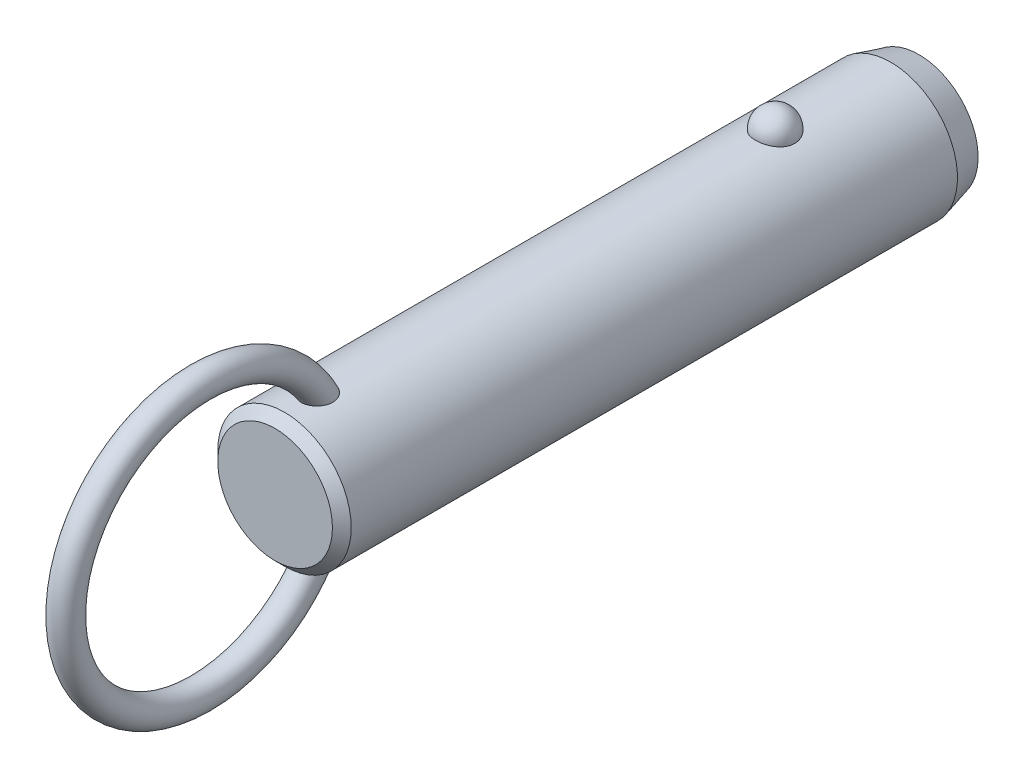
ISO-10303-21;
HEADER;
FILE_DESCRIPTION(('STEP AP214'),'2;1');
FILE_NAME('part.step','',(''),(''),'','','');
FILE_SCHEMA(('AUTOMOTIVE_DESIGN { 1 0 10303 214 1 1 1 1 }'));
ENDSEC;
DATA;
#1=APPLICATION_CONTEXT('core data for automotive mechanical design processes');
#2=APPLICATION_PROTOCOL_DEFINITION('international standard','automotive_design',2000,#1);
#3=PRODUCT_CONTEXT('',#1,'mechanical');
#4=PRODUCT('Part','Part','',(#3));
#5=PRODUCT_RELATED_PRODUCT_CATEGORY('part','',(#4));
#6=PRODUCT_DEFINITION_FORMATION('','',#4);
#7=PRODUCT_DEFINITION_CONTEXT('part definition',#1,'design');
#8=PRODUCT_DEFINITION('design','',#6,#7);
#9=PRODUCT_DEFINITION_SHAPE('','',#8);
#10=(LENGTH_UNIT() NAMED_UNIT(*) SI_UNIT(.MILLI.,.METRE.));
#11=(NAMED_UNIT(*) PLANE_ANGLE_UNIT() SI_UNIT($,.RADIAN.));
#12=(NAMED_UNIT(*) SI_UNIT($,.STERADIAN.) SOLID_ANGLE_UNIT());
#13=UNCERTAINTY_MEASURE_WITH_UNIT(LENGTH_MEASURE(1.E-05),#10,'distance_accuracy_value','');
#14=(GEOMETRIC_REPRESENTATION_CONTEXT(3) GLOBAL_UNCERTAINTY_ASSIGNED_CONTEXT((#13)) GLOBAL_UNIT_ASSIGNED_CONTEXT((#10,
#11,#12)) REPRESENTATION_CONTEXT('',''));
#15=CARTESIAN_POINT('',(0.,0.,0.));
#16=DIRECTION('',(0.,0.,1.));
#17=DIRECTION('',(1.,0.,0.));
#18=AXIS2_PLACEMENT_3D('',#15,#16,#17);
#19=CARTESIAN_POINT('',(0.,0.,43.2));
#20=DIRECTION('',(0.,0.,-1.));
#21=DIRECTION('',(-1.,0.,0.));
#22=AXIS2_PLACEMENT_3D('',#19,#20,#21);
#23=CYLINDRICAL_SURFACE('',#22,7.1);
#24=CARTESIAN_POINT('',(2.0769088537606,6.78943661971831,-2.1));
#25=CARTESIAN_POINT('',(2.07690739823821,6.78943796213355,-1.98268154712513));
#26=CARTESIAN_POINT('',(2.06738130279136,6.79237331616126,-1.86534506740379));
#27=CARTESIAN_POINT('',(2.0295040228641,6.8037853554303,-1.63400788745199));
#28=CARTESIAN_POINT('',(2.00114757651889,6.81226358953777,-1.52000812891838));
#29=CARTESIAN_POINT('',(1.92632025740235,6.83379798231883,-1.29863433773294));
#30=CARTESIAN_POINT('',(1.87985726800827,6.84685214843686,-1.19125744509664));
#31=CARTESIAN_POINT('',(1.76995205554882,6.87608091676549,-0.986046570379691));
#32=CARTESIAN_POINT('',(1.70650980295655,6.8922555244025,-0.888212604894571));
#33=CARTESIAN_POINT('',(1.56381192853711,6.92602930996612,-0.704242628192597));
#34=CARTESIAN_POINT('',(1.4844714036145,6.94363582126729,-0.618173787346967));
#35=CARTESIAN_POINT('',(1.31221746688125,6.97823658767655,-0.460740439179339));
#36=CARTESIAN_POINT('',(1.21930409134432,6.99523084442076,-0.389375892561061));
#37=CARTESIAN_POINT('',(1.02268781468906,7.02666176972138,-0.263547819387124));
#38=CARTESIAN_POINT('',(0.919020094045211,7.04110638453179,-0.209031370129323));
#39=CARTESIAN_POINT('',(0.703548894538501,7.06588726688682,-0.118163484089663));
#40=CARTESIAN_POINT('',(0.591746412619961,7.07622403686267,-0.081809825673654));
#41=CARTESIAN_POINT('',(0.365557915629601,7.09147068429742,-0.0288711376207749));
#42=CARTESIAN_POINT('',(0.251267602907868,7.09648447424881,-0.0119070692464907));
#43=CARTESIAN_POINT('',(0.0213499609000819,7.10089837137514,0.00304925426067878));
#44=CARTESIAN_POINT('',(-0.0942772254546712,7.10029907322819,0.00104351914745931));
#45=CARTESIAN_POINT('',(-0.321651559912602,7.09360829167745,-0.0216931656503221));
#46=CARTESIAN_POINT('',(-0.433431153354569,7.08760388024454,-0.0421272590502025));
#47=CARTESIAN_POINT('',(-0.651862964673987,7.07086131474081,-0.100729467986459));
#48=CARTESIAN_POINT('',(-0.758515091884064,7.06012307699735,-0.138897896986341));
#49=CARTESIAN_POINT('',(-0.96444924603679,7.03496097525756,-0.232213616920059));
#50=CARTESIAN_POINT('',(-1.06368095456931,7.02051445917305,-0.287465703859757));
#51=CARTESIAN_POINT('',(-1.25145353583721,6.98948740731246,-0.413383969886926));
#52=CARTESIAN_POINT('',(-1.33999321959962,6.97290663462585,-0.48405186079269));
#53=CARTESIAN_POINT('',(-1.50591604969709,6.93898770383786,-0.640594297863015));
#54=CARTESIAN_POINT('',(-1.58302488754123,6.92164094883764,-0.72675782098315));
#55=CARTESIAN_POINT('',(-1.72189320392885,6.8884103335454,-0.910927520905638));
#56=CARTESIAN_POINT('',(-1.78365144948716,6.87252659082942,-1.008934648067));
#57=CARTESIAN_POINT('',(-1.89101272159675,6.84377189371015,-1.21549497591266));
#58=CARTESIAN_POINT('',(-1.93639553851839,6.83094274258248,-1.32416860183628));
#59=CARTESIAN_POINT('',(-2.00874275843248,6.81002070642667,-1.54791500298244));
#60=CARTESIAN_POINT('',(-2.03570774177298,6.80192767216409,-1.66298757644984));
#61=CARTESIAN_POINT('',(-2.07047276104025,6.7914266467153,-1.89571453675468));
#62=CARTESIAN_POINT('',(-2.07835878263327,6.78899315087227,-2.01335491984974));
#63=CARTESIAN_POINT('',(-2.07502083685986,6.79001409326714,-2.24833570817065));
#64=CARTESIAN_POINT('',(-2.06379746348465,6.7934683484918,-2.36567612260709));
#65=CARTESIAN_POINT('',(-2.02263913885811,6.80583442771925,-2.59603194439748));
#66=CARTESIAN_POINT('',(-1.99281127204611,6.81471501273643,-2.70906820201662));
#67=CARTESIAN_POINT('',(-1.91526639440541,6.83691232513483,-2.92836575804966));
#68=CARTESIAN_POINT('',(-1.8675486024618,6.85022924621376,-3.03462676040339));
#69=CARTESIAN_POINT('',(-1.75504492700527,6.87991336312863,-3.23806487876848));
#70=CARTESIAN_POINT('',(-1.69015924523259,6.89629822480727,-3.33518422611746));
#71=CARTESIAN_POINT('',(-1.54505404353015,6.93024852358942,-3.51697105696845));
#72=CARTESIAN_POINT('',(-1.46483385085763,6.94781401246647,-3.60163799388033));
#73=CARTESIAN_POINT('',(-1.29071406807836,6.98225977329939,-3.75654119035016));
#74=CARTESIAN_POINT('',(-1.19675650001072,6.99913673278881,-3.82671308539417));
#75=CARTESIAN_POINT('',(-0.997940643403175,7.03023618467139,-3.9501837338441));
#76=CARTESIAN_POINT('',(-0.893083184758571,7.04445887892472,-4.00348377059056));
#77=CARTESIAN_POINT('',(-0.676902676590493,7.06848365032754,-4.09107242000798));
#78=CARTESIAN_POINT('',(-0.565686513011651,7.0783430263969,-4.12560889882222));
#79=CARTESIAN_POINT('',(-0.33873982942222,7.09282534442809,-4.17575450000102));
#80=CARTESIAN_POINT('',(-0.223009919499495,7.09744899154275,-4.19136617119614));
#81=CARTESIAN_POINT('',(0.00707628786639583,7.10090930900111,-4.20307965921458));
#82=CARTESIAN_POINT('',(0.121410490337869,7.09986531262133,-4.19958377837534));
#83=CARTESIAN_POINT('',(0.347815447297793,7.092380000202,-4.17411564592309));
#84=CARTESIAN_POINT('',(0.459886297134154,7.08593891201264,-4.15214417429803));
#85=CARTESIAN_POINT('',(0.678084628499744,7.06838983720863,-4.09049562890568));
#86=CARTESIAN_POINT('',(0.784237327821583,7.05730369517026,-4.05090137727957));
#87=CARTESIAN_POINT('',(0.988305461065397,7.03163139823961,-3.95511447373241));
#88=CARTESIAN_POINT('',(1.08622031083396,7.01704499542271,-3.89892064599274));
#89=CARTESIAN_POINT('',(1.27284490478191,6.98562668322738,-3.77035541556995));
#90=CARTESIAN_POINT('',(1.36137372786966,6.96876135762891,-3.69772964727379));
#91=CARTESIAN_POINT('',(1.52509486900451,6.93477412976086,-3.53878279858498));
#92=CARTESIAN_POINT('',(1.60028496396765,6.91765218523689,-3.45245943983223));
#93=CARTESIAN_POINT('',(1.73681688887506,6.88465753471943,-3.26658774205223));
#94=CARTESIAN_POINT('',(1.79785966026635,6.86881574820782,-3.16681408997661));
#95=CARTESIAN_POINT('',(1.90265327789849,6.84053157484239,-2.95814408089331));
#96=CARTESIAN_POINT('',(1.94640861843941,6.82808830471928,-2.84925010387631));
#97=CARTESIAN_POINT('',(2.01274378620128,6.80881460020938,-2.63454318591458));
#98=CARTESIAN_POINT('',(2.03676193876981,6.80160856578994,-2.52920574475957));
#99=CARTESIAN_POINT('',(2.06884490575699,6.79191902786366,-2.3159172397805));
#100=CARTESIAN_POINT('',(2.07691019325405,6.78943538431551,-2.20796625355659));
#101=CARTESIAN_POINT('',(2.0769088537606,6.78943661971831,-2.1));
#102=B_SPLINE_CURVE_WITH_KNOTS('',3,(#24,#25,#26,#27,#28,#29,#30,#31,#32,#33,#34,#35,#36,#37,
#38,#39,#40,#41,#42,#43,#44,#45,#46,#47,#48,#49,#50,#51,#52,#53,#54,#55,#56,#57,#58,#59,#60,#61,
#62,#63,#64,#65,#66,#67,#68,#69,#70,#71,#72,#73,#74,#75,#76,#77,#78,#79,#80,#81,#82,#83,#84,#85,
#86,#87,#88,#89,#90,#91,#92,#93,#94,#95,#96,#97,#98,#99,#100,#101),.UNSPECIFIED.,.T.,.F.,(4,2,2,
2,2,2,2,2,2,2,2,2,2,2,2,2,2,2,2,2,2,2,2,2,2,2,2,2,2,2,2,2,2,2,2,2,2,2,4),(0.,0.351568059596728,
0.703234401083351,1.05474780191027,1.40626181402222,1.75970563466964,2.11314851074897,
2.4654696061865,2.81774759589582,3.16301449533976,3.50824481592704,3.84801136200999,
4.18778391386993,4.52968352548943,4.87162112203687,5.22076181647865,5.56993054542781,
5.92363364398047,6.27732559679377,6.62942052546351,6.98150450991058,7.33158042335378,
7.68167162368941,8.03384443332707,8.38603269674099,8.73975272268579,9.09344583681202,
9.44234545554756,9.79119807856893,10.1327344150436,10.4742563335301,10.8141898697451,
11.1541474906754,11.4997793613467,11.8454687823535,12.1979079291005,12.5502553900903,
12.8738073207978,13.1973496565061),.UNSPECIFIED.);
#103=CARTESIAN_POINT('',(2.0769088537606,6.78943661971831,-2.1));
#104=VERTEX_POINT('',#103);
#105=EDGE_CURVE('E41',#104,#104,#102,.T.);
#106=ORIENTED_EDGE('',*,*,#105,.T.);
#107=EDGE_LOOP('',(#106));
#108=FACE_BOUND('',#107,.T.);
#109=CARTESIAN_POINT('',(0.,0.,50.12));
#110=DIRECTION('',(0.,0.,1.));
#111=DIRECTION('',(1.,0.,0.));
#112=AXIS2_PLACEMENT_3D('',#109,#110,#111);
#113=CIRCLE('',#112,7.1);
#114=CARTESIAN_POINT('',(7.1,0.,50.12));
#115=VERTEX_POINT('',#114);
#116=EDGE_CURVE('E10',#115,#115,#113,.F.);
#117=ORIENTED_EDGE('',*,*,#116,.T.);
#118=EDGE_LOOP('',(#117));
#119=FACE_BOUND('',#118,.T.);
#120=CARTESIAN_POINT('',(-0.429539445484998,-7.08699541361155,44.9429212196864));
#121=CARTESIAN_POINT('',(-0.50833166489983,-7.08221999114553,44.9668764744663));
#122=CARTESIAN_POINT('',(-0.585039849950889,-7.07624016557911,44.9974570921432));
#123=CARTESIAN_POINT('',(-0.732082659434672,-7.06254296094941,45.0710242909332));
#124=CARTESIAN_POINT('',(-0.802417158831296,-7.05482554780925,45.1140111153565));
#125=CARTESIAN_POINT('',(-0.934722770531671,-7.03851844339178,45.2111135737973));
#126=CARTESIAN_POINT('',(-0.996700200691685,-7.02992941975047,45.2652207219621));
#127=CARTESIAN_POINT('',(-1.11079942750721,-7.01280697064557,45.3829676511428));
#128=CARTESIAN_POINT('',(-1.16292136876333,-7.00427354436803,45.4466072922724));
#129=CARTESIAN_POINT('',(-1.25705660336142,-6.98799959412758,45.5826870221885));
#130=CARTESIAN_POINT('',(-1.29888032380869,-6.98027525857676,45.6552598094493));
#131=CARTESIAN_POINT('',(-1.37069920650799,-6.96652886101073,45.8061686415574));
#132=CARTESIAN_POINT('',(-1.40069157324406,-6.96050720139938,45.8845060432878));
#133=CARTESIAN_POINT('',(-1.45043507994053,-6.95031881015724,46.0501903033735));
#134=CARTESIAN_POINT('',(-1.46937115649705,-6.94630231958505,46.1377897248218));
#135=CARTESIAN_POINT('',(-1.49424917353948,-6.94099239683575,46.3148714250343));
#136=CARTESIAN_POINT('',(-1.50018601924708,-6.93970003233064,46.4043544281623));
#137=CARTESIAN_POINT('',(-1.49978214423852,-6.93978815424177,46.5940607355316));
#138=CARTESIAN_POINT('',(-1.49187639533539,-6.94150934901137,46.694279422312));
#139=CARTESIAN_POINT('',(-1.46177925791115,-6.94790814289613,46.8924798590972));
#140=CARTESIAN_POINT('',(-1.43957541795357,-6.95258831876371,46.990459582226));
#141=CARTESIAN_POINT('',(-1.37783293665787,-6.96510647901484,47.1953629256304));
#142=CARTESIAN_POINT('',(-1.33634073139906,-6.97328848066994,47.3016801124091));
#143=CARTESIAN_POINT('',(-1.23686994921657,-6.99161706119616,47.5061777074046));
#144=CARTESIAN_POINT('',(-1.17889192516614,-7.00176357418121,47.6043583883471));
#145=CARTESIAN_POINT('',(-1.0587512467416,-7.02082898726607,47.7723743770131));
#146=CARTESIAN_POINT('',(-0.999247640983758,-7.02963746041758,47.8441230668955));
#147=CARTESIAN_POINT('',(-0.86949477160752,-7.04686074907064,47.9771959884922));
#148=CARTESIAN_POINT('',(-0.799263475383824,-7.05527619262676,48.0385372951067));
#149=CARTESIAN_POINT('',(-0.665408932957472,-7.06899457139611,48.1351316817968));
#150=CARTESIAN_POINT('',(-0.603817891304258,-7.07457275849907,48.1731512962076));
#151=CARTESIAN_POINT('',(-0.475172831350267,-7.08437420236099,48.2387581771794));
#152=CARTESIAN_POINT('',(-0.40812301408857,-7.08859848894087,48.2663533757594));
#153=CARTESIAN_POINT('',(-0.269431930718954,-7.09522749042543,48.3092569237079));
#154=CARTESIAN_POINT('',(-0.197757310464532,-7.09761688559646,48.3244618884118));
#155=CARTESIAN_POINT('',(-0.0527849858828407,-7.10017268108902,48.3407168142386));
#156=CARTESIAN_POINT('',(0.020511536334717,-7.10034065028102,48.3417767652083));
#157=CARTESIAN_POINT('',(0.156426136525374,-7.09855986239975,48.3304619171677));
#158=CARTESIAN_POINT('',(0.219199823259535,-7.09688191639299,48.3198060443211));
#159=CARTESIAN_POINT('',(0.342134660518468,-7.09201880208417,48.2885379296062));
#160=CARTESIAN_POINT('',(0.402295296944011,-7.08883333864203,48.2679237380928));
#161=CARTESIAN_POINT('',(0.520687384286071,-7.08113868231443,48.2172125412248));
#162=CARTESIAN_POINT('',(0.578791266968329,-7.07658958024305,48.1868272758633));
#163=CARTESIAN_POINT('',(0.690173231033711,-7.06659708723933,48.1183678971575));
#164=CARTESIAN_POINT('',(0.743447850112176,-7.061153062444,48.0802883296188));
#165=CARTESIAN_POINT('',(0.870947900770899,-7.04680292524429,47.9765929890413));
#166=CARTESIAN_POINT('',(0.941828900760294,-7.0375580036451,47.9068972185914));
#167=CARTESIAN_POINT('',(1.07136606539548,-7.01900793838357,47.7569450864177));
#168=CARTESIAN_POINT('',(1.13000013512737,-7.00970271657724,47.6766700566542));
#169=CARTESIAN_POINT('',(1.23579584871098,-6.99183327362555,47.5068997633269));
#170=CARTESIAN_POINT('',(1.2827427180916,-6.98328455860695,47.4172696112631));
#171=CARTESIAN_POINT('',(1.36351442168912,-6.96796352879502,47.2321763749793));
#172=CARTESIAN_POINT('',(1.39733971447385,-6.96119115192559,47.1367134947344));
#173=CARTESIAN_POINT('',(1.45579181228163,-6.94922464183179,46.9253092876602));
#174=CARTESIAN_POINT('',(1.47790145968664,-6.94449000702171,46.808631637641));
#175=CARTESIAN_POINT('',(1.50168752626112,-6.93938731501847,46.5730153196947));
#176=CARTESIAN_POINT('',(1.50336085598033,-6.93901991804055,46.4540763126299));
#177=CARTESIAN_POINT('',(1.48486516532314,-6.9430010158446,46.2236079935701));
#178=CARTESIAN_POINT('',(1.46573441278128,-6.9471253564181,46.1119958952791));
#179=CARTESIAN_POINT('',(1.40606892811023,-6.95944667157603,45.8948868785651));
#180=CARTESIAN_POINT('',(1.36556446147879,-6.96763788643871,45.7893815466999));
#181=CARTESIAN_POINT('',(1.27082700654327,-6.98548038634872,45.6042879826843));
#182=CARTESIAN_POINT('',(1.21949810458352,-6.99473841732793,45.5231719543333));
#183=CARTESIAN_POINT('',(1.10242050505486,-7.01414069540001,45.3722278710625));
#184=CARTESIAN_POINT('',(1.03668119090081,-7.02428436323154,45.3023925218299));
#185=CARTESIAN_POINT('',(0.90055902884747,-7.04295285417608,45.1835735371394));
#186=CARTESIAN_POINT('',(0.831428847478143,-7.05153466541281,45.1331573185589));
#187=CARTESIAN_POINT('',(0.685291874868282,-7.06723150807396,45.0451429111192));
#188=CARTESIAN_POINT('',(0.60828720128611,-7.0743469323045,45.0075412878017));
#189=CARTESIAN_POINT('',(0.451878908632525,-7.08602232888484,44.9474915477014));
#190=CARTESIAN_POINT('',(0.372686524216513,-7.09067127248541,44.9245088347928));
#191=CARTESIAN_POINT('',(0.211477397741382,-7.09730788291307,44.8920357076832));
#192=CARTESIAN_POINT('',(0.129460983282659,-7.09929585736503,44.8825437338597));
#193=CARTESIAN_POINT('',(-0.0332905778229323,-7.10037858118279,44.8773517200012));
#194=CARTESIAN_POINT('',(-0.114016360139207,-7.09953334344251,44.8813656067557));
#195=CARTESIAN_POINT('',(-0.273670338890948,-7.09517338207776,44.9024540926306));
#196=CARTESIAN_POINT('',(-0.352598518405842,-7.09165863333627,44.9195288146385));
#197=CARTESIAN_POINT('',(-0.429539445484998,-7.08699541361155,44.9429212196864));
#198=B_SPLINE_CURVE_WITH_KNOTS('',3,(#120,#121,#122,#123,#124,#125,#126,#127,#128,#129,#130,
#131,#132,#133,#134,#135,#136,#137,#138,#139,#140,#141,#142,#143,#144,#145,#146,#147,#148,#149,
#150,#151,#152,#153,#154,#155,#156,#157,#158,#159,#160,#161,#162,#163,#164,#165,#166,#167,#168,
#169,#170,#171,#172,#173,#174,#175,#176,#177,#178,#179,#180,#181,#182,#183,#184,#185,#186,#187,
#188,#189,#190,#191,#192,#193,#194,#195,#196,#197),.UNSPECIFIED.,.T.,.F.,(4,2,2,2,2,2,2,2,2,2,2,
2,2,2,2,2,2,2,2,2,2,2,2,2,2,2,2,2,2,2,2,2,2,2,2,2,2,2,4),(0.,0.247183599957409,
0.494372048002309,0.741372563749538,0.98836945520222,1.23962059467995,1.49093106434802,
1.75897818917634,2.02713035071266,2.32758265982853,2.62829697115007,2.97008736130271,
3.31186629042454,3.5917531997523,3.87117637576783,4.08813841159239,4.30493502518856,
4.52352259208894,4.74195577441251,4.93215328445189,5.12238804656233,5.31884850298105,
5.51544871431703,5.8133231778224,6.11173048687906,6.41527266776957,6.71880423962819,
7.073581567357,7.42841252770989,7.76631485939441,8.10373999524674,8.3914224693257,
8.67891817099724,8.93560332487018,9.19221962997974,9.43881106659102,9.68537399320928,
9.92674752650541,10.1681233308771),.UNSPECIFIED.);
#199=CARTESIAN_POINT('',(-0.429539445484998,-7.08699541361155,44.9429212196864));
#200=VERTEX_POINT('',#199);
#201=EDGE_CURVE('E60',#200,#200,#198,.T.);
#202=ORIENTED_EDGE('',*,*,#201,.T.);
#203=EDGE_LOOP('',(#202));
#204=FACE_BOUND('',#203,.T.);
#205=CARTESIAN_POINT('',(-0.429539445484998,7.08699541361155,44.9429212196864));
#206=CARTESIAN_POINT('',(-0.351665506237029,7.09171429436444,44.9192469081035));
#207=CARTESIAN_POINT('',(-0.271733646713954,7.09525896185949,44.9020369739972));
#208=CARTESIAN_POINT('',(-0.110026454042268,7.09960839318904,44.8810059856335));
#209=CARTESIAN_POINT('',(-0.0282502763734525,7.10041187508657,44.877191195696));
#210=CARTESIAN_POINT('',(0.134782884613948,7.09918849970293,44.883059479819));
#211=CARTESIAN_POINT('',(0.216039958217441,7.09716214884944,44.8927401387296));
#212=CARTESIAN_POINT('',(0.375730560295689,7.09050177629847,44.9253471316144));
#213=CARTESIAN_POINT('',(0.454164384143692,7.08586802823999,44.9482720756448));
#214=CARTESIAN_POINT('',(0.606025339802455,7.07449911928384,45.006771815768));
#215=CARTESIAN_POINT('',(0.679451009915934,7.06776334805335,45.0423502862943));
#216=CARTESIAN_POINT('',(0.819234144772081,7.05292866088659,45.1251753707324));
#217=CARTESIAN_POINT('',(0.885591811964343,7.04482978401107,45.1724216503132));
#218=CARTESIAN_POINT('',(1.00993211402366,7.02808709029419,45.2775902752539));
#219=CARTESIAN_POINT('',(1.06785399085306,7.01943990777,45.335583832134));
#220=CARTESIAN_POINT('',(1.17342527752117,7.00256662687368,45.4603013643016));
#221=CARTESIAN_POINT('',(1.22107408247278,6.99434055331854,45.5270258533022));
#222=CARTESIAN_POINT('',(1.30652927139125,6.97889183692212,45.6693622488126));
#223=CARTESIAN_POINT('',(1.34399711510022,6.97170674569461,45.7451808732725));
#224=CARTESIAN_POINT('',(1.40682616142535,6.95930080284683,45.9018100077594));
#225=CARTESIAN_POINT('',(1.43218374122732,6.95408053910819,45.9826220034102));
#226=CARTESIAN_POINT('',(1.47246409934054,6.94566853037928,46.1535314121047));
#227=CARTESIAN_POINT('',(1.48642590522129,6.9426653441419,46.2438630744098));
#228=CARTESIAN_POINT('',(1.5011410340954,6.93949744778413,46.425619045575));
#229=CARTESIAN_POINT('',(1.50188917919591,6.93933385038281,46.5170437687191));
#230=CARTESIAN_POINT('',(1.49030464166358,6.94183245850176,46.7108438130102));
#231=CARTESIAN_POINT('',(1.47627413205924,6.94486147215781,46.813112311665));
#232=CARTESIAN_POINT('',(1.43356351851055,6.95380194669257,47.0144719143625));
#233=CARTESIAN_POINT('',(1.4048676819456,6.95971650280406,47.1135594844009));
#234=CARTESIAN_POINT('',(1.32908750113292,6.97461208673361,47.3189087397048));
#235=CARTESIAN_POINT('',(1.28011435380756,6.98388945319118,47.4244566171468));
#236=CARTESIAN_POINT('',(1.16520357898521,7.00397743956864,47.6257604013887));
#237=CARTESIAN_POINT('',(1.09927694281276,7.01478706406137,47.7215225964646));
#238=CARTESIAN_POINT('',(0.969361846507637,7.03373936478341,47.8767565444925));
#239=CARTESIAN_POINT('',(0.909042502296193,7.04187023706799,47.9393032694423));
#240=CARTESIAN_POINT('',(0.779178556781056,7.05741732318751,48.0540535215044));
#241=CARTESIAN_POINT('',(0.709649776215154,7.06483472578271,48.1062744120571));
#242=CARTESIAN_POINT('',(0.576854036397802,7.0767751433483,48.1881138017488));
#243=CARTESIAN_POINT('',(0.515118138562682,7.08158033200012,48.2201641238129));
#244=CARTESIAN_POINT('',(0.387127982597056,7.08972701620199,48.2737656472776));
#245=CARTESIAN_POINT('',(0.320877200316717,7.09306962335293,48.2953248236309));
#246=CARTESIAN_POINT('',(0.185041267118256,7.09791507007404,48.3264005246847));
#247=CARTESIAN_POINT('',(0.115437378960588,7.09940591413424,48.3358385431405));
#248=CARTESIAN_POINT('',(-0.0243157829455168,7.10030171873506,48.3415226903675));
#249=CARTESIAN_POINT('',(-0.094464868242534,7.0997073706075,48.3377731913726));
#250=CARTESIAN_POINT('',(-0.225713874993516,7.09668414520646,48.3185081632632));
#251=CARTESIAN_POINT('',(-0.287006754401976,7.09444865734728,48.3042323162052));
#252=CARTESIAN_POINT('',(-0.406555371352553,7.08860360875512,48.2663685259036));
#253=CARTESIAN_POINT('',(-0.464809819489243,7.08499346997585,48.2427766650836));
#254=CARTESIAN_POINT('',(-0.594955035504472,7.07541654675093,48.1789232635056));
#255=CARTESIAN_POINT('',(-0.665389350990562,7.06906574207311,48.135753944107));
#256=CARTESIAN_POINT('',(-0.798242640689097,7.05530261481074,48.038587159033));
#257=CARTESIAN_POINT('',(-0.860645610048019,7.0478882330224,47.9845686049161));
#258=CARTESIAN_POINT('',(-0.994249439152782,7.03045217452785,47.8509965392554));
#259=CARTESIAN_POINT('',(-1.06260129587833,7.02030745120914,47.7686143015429));
#260=CARTESIAN_POINT('',(-1.18502045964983,7.00068382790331,47.593843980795));
#261=CARTESIAN_POINT('',(-1.239076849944,6.99120544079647,47.501448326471));
#262=CARTESIAN_POINT('',(-1.33335589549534,6.97384343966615,47.3080085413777));
#263=CARTESIAN_POINT('',(-1.3733613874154,6.96598557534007,47.2068564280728));
#264=CARTESIAN_POINT('',(-1.43770677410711,6.9529905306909,46.9995046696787));
#265=CARTESIAN_POINT('',(-1.46204473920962,6.94785368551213,46.89330440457));
#266=CARTESIAN_POINT('',(-1.49537533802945,6.94076296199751,46.668231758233));
#267=CARTESIAN_POINT('',(-1.50273564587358,6.93914842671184,46.5490975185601));
#268=CARTESIAN_POINT('',(-1.4954555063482,6.94072368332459,46.3114703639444));
#269=CARTESIAN_POINT('',(-1.48082914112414,6.94391040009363,46.1929770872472));
#270=CARTESIAN_POINT('',(-1.43076401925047,6.95438579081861,45.9734325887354));
#271=CARTESIAN_POINT('',(-1.39762227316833,6.96121852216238,45.8718413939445));
#272=CARTESIAN_POINT('',(-1.31211274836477,6.97783941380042,45.6773513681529));
#273=CARTESIAN_POINT('',(-1.25976607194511,6.98762432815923,45.5844431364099));
#274=CARTESIAN_POINT('',(-1.14583073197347,7.00713153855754,45.4241601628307));
#275=CARTESIAN_POINT('',(-1.08665947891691,7.01665982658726,45.3550351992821));
#276=CARTESIAN_POINT('',(-0.956606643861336,7.03556646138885,45.2288786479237));
#277=CARTESIAN_POINT('',(-0.885737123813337,7.04494495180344,45.1718347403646));
#278=CARTESIAN_POINT('',(-0.751558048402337,7.06035735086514,45.0831004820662));
#279=CARTESIAN_POINT('',(-0.690120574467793,7.0666695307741,45.0485932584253));
#280=CARTESIAN_POINT('',(-0.562815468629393,7.07794609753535,44.9887507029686));
#281=CARTESIAN_POINT('',(-0.496948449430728,7.08291067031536,44.9634141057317));
#282=CARTESIAN_POINT('',(-0.429539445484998,7.08699541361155,44.9429212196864));
#283=B_SPLINE_CURVE_WITH_KNOTS('',3,(#205,#206,#207,#208,#209,#210,#211,#212,#213,#214,#215,
#216,#217,#218,#219,#220,#221,#222,#223,#224,#225,#226,#227,#228,#229,#230,#231,#232,#233,#234,
#235,#236,#237,#238,#239,#240,#241,#242,#243,#244,#245,#246,#247,#248,#249,#250,#251,#252,#253,
#254,#255,#256,#257,#258,#259,#260,#261,#262,#263,#264,#265,#266,#267,#268,#269,#270,#271,#272,
#273,#274,#275,#276,#277,#278,#279,#280,#281,#282),.UNSPECIFIED.,.T.,.F.,(4,2,2,2,2,2,2,2,2,2,2,
2,2,2,2,2,2,2,2,2,2,2,2,2,2,2,2,2,2,2,2,2,2,2,2,2,2,2,4),(0.,0.244335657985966,
0.488785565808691,0.733191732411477,0.977572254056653,1.22202379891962,1.46646834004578,
1.71259457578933,1.9587352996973,2.21226768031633,2.46587585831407,2.73913816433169,
3.01250754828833,3.32109936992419,3.63002293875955,3.97863512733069,4.32702187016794,
4.5879394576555,4.84841449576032,5.05676704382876,5.26496096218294,5.47449661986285,
5.68396281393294,5.87205447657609,6.06022532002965,6.30743751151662,6.55513496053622,
6.87602468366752,7.19715875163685,7.52305774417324,7.84899686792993,8.20516155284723,
8.5610982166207,8.88040084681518,9.19935367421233,9.47236282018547,9.74509220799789,
9.95662250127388,10.1681235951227),.UNSPECIFIED.);
#284=CARTESIAN_POINT('',(-0.429539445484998,7.08699541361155,44.9429212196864));
#285=VERTEX_POINT('',#284);
#286=EDGE_CURVE('E68',#285,#285,#283,.T.);
#287=ORIENTED_EDGE('',*,*,#286,.T.);
#288=EDGE_LOOP('',(#287));
#289=FACE_BOUND('',#288,.T.);
#290=CARTESIAN_POINT('',(0.,0.,-14.4));
#291=DIRECTION('',(0.,0.,-1.));
#292=DIRECTION('',(-1.,0.,0.));
#293=AXIS2_PLACEMENT_3D('',#290,#291,#292);
#294=CIRCLE('',#293,7.1);
#295=CARTESIAN_POINT('',(-7.1,0.,-14.4));
#296=VERTEX_POINT('',#295);
#297=EDGE_CURVE('E57',#296,#296,#294,.F.);
#298=ORIENTED_EDGE('',*,*,#297,.T.);
#299=EDGE_LOOP('',(#298));
#300=FACE_BOUND('',#299,.T.);
#301=ADVANCED_FACE('F37',(#108,#119,#204,#289,#300),#23,.T.);
#302=CARTESIAN_POINT('',(0.,0.,-17.4));
#303=DIRECTION('',(0.,0.,-1.));
#304=DIRECTION('',(-1.,0.,0.));
#305=AXIS2_PLACEMENT_3D('',#302,#303,#304);
#306=PLANE('',#305);
#307=CARTESIAN_POINT('',(0.,0.,-17.4));
#308=DIRECTION('',(0.,0.,-1.));
#309=DIRECTION('',(-1.,0.,0.));
#310=AXIS2_PLACEMENT_3D('',#307,#308,#309);
#311=CIRCLE('',#310,6.29615242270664);
#312=CARTESIAN_POINT('',(-6.29615242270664,0.,-17.4));
#313=VERTEX_POINT('',#312);
#314=EDGE_CURVE('E67',#313,#313,#311,.T.);
#315=ORIENTED_EDGE('',*,*,#314,.T.);
#316=EDGE_LOOP('',(#315));
#317=FACE_BOUND('',#316,.T.);
#318=ADVANCED_FACE('F86',(#317),#306,.T.);
#319=CARTESIAN_POINT('',(0.,0.,-17.4));
#320=DIRECTION('',(0.,0.,1.));
#321=DIRECTION('',(1.,0.,0.));
#322=AXIS2_PLACEMENT_3D('',#319,#320,#321);
#323=CONICAL_SURFACE('',#322,6.29615242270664,0.261799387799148);
#324=ORIENTED_EDGE('',*,*,#297,.F.);
#325=EDGE_LOOP('',(#324));
#326=FACE_BOUND('',#325,.T.);
#327=ORIENTED_EDGE('',*,*,#314,.F.);
#328=EDGE_LOOP('',(#327));
#329=FACE_BOUND('',#328,.T.);
#330=ADVANCED_FACE('F84',(#326,#329),#323,.T.);
#331=CARTESIAN_POINT('',(0.,0.,51.12));
#332=DIRECTION('',(0.,0.,1.));
#333=DIRECTION('',(1.,0.,0.));
#334=AXIS2_PLACEMENT_3D('',#331,#332,#333);
#335=PLANE('',#334);
#336=CARTESIAN_POINT('',(0.,0.,51.12));
#337=DIRECTION('',(0.,0.,1.));
#338=DIRECTION('',(1.,0.,0.));
#339=AXIS2_PLACEMENT_3D('',#336,#337,#338);
#340=CIRCLE('',#339,6.10000000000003);
#341=CARTESIAN_POINT('',(6.10000000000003,0.,51.12));
#342=VERTEX_POINT('',#341);
#343=EDGE_CURVE('E50',#342,#342,#340,.T.);
#344=ORIENTED_EDGE('',*,*,#343,.T.);
#345=EDGE_LOOP('',(#344));
#346=FACE_BOUND('',#345,.T.);
#347=ADVANCED_FACE('F78',(#346),#335,.T.);
#348=CARTESIAN_POINT('',(0.,0.,59.05));
#349=DIRECTION('',(1.,0.,0.));
#350=DIRECTION('',(0.,0.,-1.));
#351=AXIS2_PLACEMENT_3D('',#348,#349,#350);
#352=TOROIDAL_SURFACE('',#351,14.35,1.5);
#353=ORIENTED_EDGE('',*,*,#286,.F.);
#354=EDGE_LOOP('',(#353));
#355=FACE_BOUND('',#354,.T.);
#356=ORIENTED_EDGE('',*,*,#201,.F.);
#357=EDGE_LOOP('',(#356));
#358=FACE_BOUND('',#357,.T.);
#359=ADVANCED_FACE('F74',(#355,#358),#352,.T.);
#360=CARTESIAN_POINT('',(0.,0.,51.12));
#361=DIRECTION('',(0.,0.,-1.));
#362=DIRECTION('',(-1.,0.,0.));
#363=AXIS2_PLACEMENT_3D('',#360,#361,#362);
#364=CONICAL_SURFACE('',#363,6.10000000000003,0.785398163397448);
#365=ORIENTED_EDGE('',*,*,#116,.F.);
#366=EDGE_LOOP('',(#365));
#367=FACE_BOUND('',#366,.T.);
#368=ORIENTED_EDGE('',*,*,#343,.F.);
#369=EDGE_LOOP('',(#368));
#370=FACE_BOUND('',#369,.T.);
#371=ADVANCED_FACE('F39',(#367,#370),#364,.T.);
#372=CARTESIAN_POINT('',(0.,7.1,-2.1));
#373=DIRECTION('',(0.,1.,0.));
#374=DIRECTION('',(0.,0.,1.));
#375=AXIS2_PLACEMENT_3D('',#372,#373,#374);
#376=SPHERICAL_SURFACE('',#375,2.10000000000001);
#377=ORIENTED_EDGE('',*,*,#105,.F.);
#378=EDGE_LOOP('',(#377));
#379=FACE_BOUND('',#378,.T.);
#380=ADVANCED_FACE('F80',(#379),#376,.T.);
#381=CLOSED_SHELL('',(#301,#318,#330,#347,#359,#371,#380));
#382=MANIFOLD_SOLID_BREP('B2',#381);
#383=ADVANCED_BREP_SHAPE_REPRESENTATION('',(#18,#382),#14);
#384=SHAPE_DEFINITION_REPRESENTATION(#9,#383);
ENDSEC;
END-ISO-10303-21;
